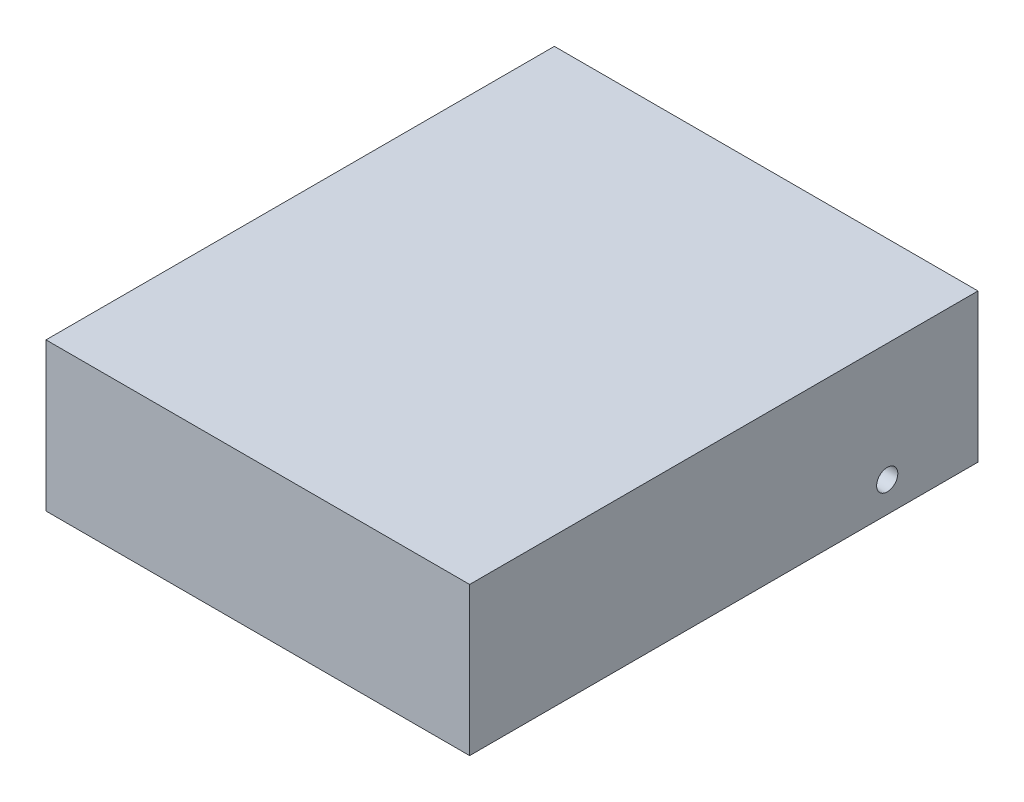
from build123d import *

# Parameters (mm, degrees)
SKETCH1_W           = 140
SKETCH1_H           = 49
BOSS_EXTRUDE1_DEPTH = 168
SKETCH2_R           = 3.5
CUT_EXTRUDE1_DEPTH  = 5


with BuildPart() as part:
    # Sketch1 → Boss-Extrude1 (new body)
    with BuildSketch(Plane.XY):
        with Locations((-29.690566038, 5.362264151)):
            Rectangle(SKETCH1_W, SKETCH1_H)
    extrude(amount=BOSS_EXTRUDE1_DEPTH)

    # Sketch2 → Cut-Extrude1 (cut)
    with BuildSketch(Plane(origin=(40.309433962, 0, 0), x_dir=(0, 0, -1), z_dir=(1, 0, 0))):
        with Locations((-30, -9.137735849)):
            Circle(SKETCH2_R)
    extrude(amount=-CUT_EXTRUDE1_DEPTH, mode=Mode.SUBTRACT)


solid = part.part
